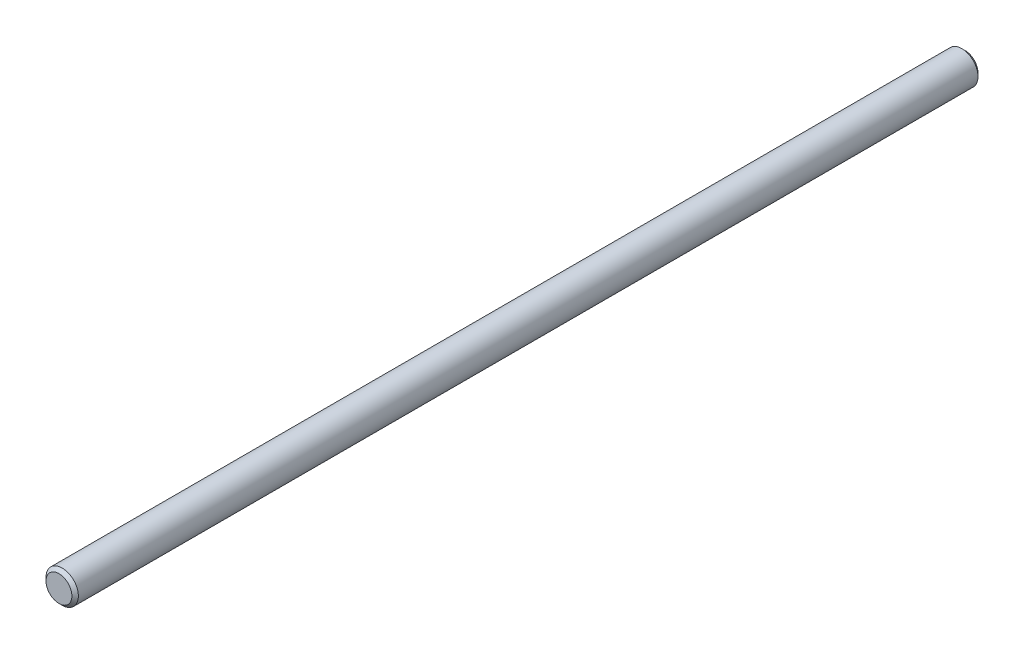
ISO-10303-21;
HEADER;
FILE_DESCRIPTION(('STEP AP214'),'2;1');
FILE_NAME('part.step','',(''),(''),'','','');
FILE_SCHEMA(('AUTOMOTIVE_DESIGN { 1 0 10303 214 1 1 1 1 }'));
ENDSEC;
DATA;
#1=APPLICATION_CONTEXT('core data for automotive mechanical design processes');
#2=APPLICATION_PROTOCOL_DEFINITION('international standard','automotive_design',2000,#1);
#3=PRODUCT_CONTEXT('',#1,'mechanical');
#4=PRODUCT('Part','Part','',(#3));
#5=PRODUCT_RELATED_PRODUCT_CATEGORY('part','',(#4));
#6=PRODUCT_DEFINITION_FORMATION('','',#4);
#7=PRODUCT_DEFINITION_CONTEXT('part definition',#1,'design');
#8=PRODUCT_DEFINITION('design','',#6,#7);
#9=PRODUCT_DEFINITION_SHAPE('','',#8);
#10=(LENGTH_UNIT() NAMED_UNIT(*) SI_UNIT(.MILLI.,.METRE.));
#11=(NAMED_UNIT(*) PLANE_ANGLE_UNIT() SI_UNIT($,.RADIAN.));
#12=(NAMED_UNIT(*) SI_UNIT($,.STERADIAN.) SOLID_ANGLE_UNIT());
#13=UNCERTAINTY_MEASURE_WITH_UNIT(LENGTH_MEASURE(1.E-05),#10,'distance_accuracy_value','');
#14=(GEOMETRIC_REPRESENTATION_CONTEXT(3) GLOBAL_UNCERTAINTY_ASSIGNED_CONTEXT((#13)) GLOBAL_UNIT_ASSIGNED_CONTEXT((#10,
#11,#12)) REPRESENTATION_CONTEXT('',''));
#15=CARTESIAN_POINT('',(0.,0.,0.));
#16=DIRECTION('',(0.,0.,1.));
#17=DIRECTION('',(1.,0.,0.));
#18=AXIS2_PLACEMENT_3D('',#15,#16,#17);
#19=CARTESIAN_POINT('',(0.,0.,56.));
#20=DIRECTION('',(0.,0.,-1.));
#21=DIRECTION('',(-1.,0.,0.));
#22=AXIS2_PLACEMENT_3D('',#19,#20,#21);
#23=CYLINDRICAL_SURFACE('',#22,1.);
#24=CARTESIAN_POINT('',(0.,0.,55.8));
#25=DIRECTION('',(0.,0.,1.));
#26=DIRECTION('',(1.,0.,0.));
#27=AXIS2_PLACEMENT_3D('',#24,#25,#26);
#28=CIRCLE('',#27,1.);
#29=CARTESIAN_POINT('',(1.,0.,55.8));
#30=VERTEX_POINT('',#29);
#31=EDGE_CURVE('E39',#30,#30,#28,.F.);
#32=ORIENTED_EDGE('',*,*,#31,.T.);
#33=EDGE_LOOP('',(#32));
#34=FACE_BOUND('',#33,.T.);
#35=CARTESIAN_POINT('',(0.,0.,0.199999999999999));
#36=DIRECTION('',(0.,0.,1.));
#37=DIRECTION('',(1.,0.,0.));
#38=AXIS2_PLACEMENT_3D('',#35,#36,#37);
#39=CIRCLE('',#38,1.);
#40=CARTESIAN_POINT('',(1.,0.,0.199999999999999));
#41=VERTEX_POINT('',#40);
#42=EDGE_CURVE('E43',#41,#41,#39,.T.);
#43=ORIENTED_EDGE('',*,*,#42,.T.);
#44=EDGE_LOOP('',(#43));
#45=FACE_BOUND('',#44,.T.);
#46=ADVANCED_FACE('F33',(#34,#45),#23,.T.);
#47=CARTESIAN_POINT('',(0.,0.,56.));
#48=DIRECTION('',(0.,0.,1.));
#49=DIRECTION('',(1.,0.,0.));
#50=AXIS2_PLACEMENT_3D('',#47,#48,#49);
#51=PLANE('',#50);
#52=CARTESIAN_POINT('',(0.,0.,56.));
#53=DIRECTION('',(0.,0.,1.));
#54=DIRECTION('',(1.,0.,0.));
#55=AXIS2_PLACEMENT_3D('',#52,#53,#54);
#56=CIRCLE('',#55,0.800000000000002);
#57=CARTESIAN_POINT('',(0.800000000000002,0.,56.));
#58=VERTEX_POINT('',#57);
#59=EDGE_CURVE('E47',#58,#58,#56,.T.);
#60=ORIENTED_EDGE('',*,*,#59,.T.);
#61=EDGE_LOOP('',(#60));
#62=FACE_BOUND('',#61,.T.);
#63=ADVANCED_FACE('F53',(#62),#51,.T.);
#64=CARTESIAN_POINT('',(0.,0.,0.));
#65=DIRECTION('',(0.,0.,1.));
#66=DIRECTION('',(1.,0.,0.));
#67=AXIS2_PLACEMENT_3D('',#64,#65,#66);
#68=PLANE('',#67);
#69=CARTESIAN_POINT('',(0.,0.,0.));
#70=DIRECTION('',(0.,0.,1.));
#71=DIRECTION('',(1.,0.,0.));
#72=AXIS2_PLACEMENT_3D('',#69,#70,#71);
#73=CIRCLE('',#72,0.800000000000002);
#74=CARTESIAN_POINT('',(0.800000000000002,0.,0.));
#75=VERTEX_POINT('',#74);
#76=EDGE_CURVE('E10',#75,#75,#73,.F.);
#77=ORIENTED_EDGE('',*,*,#76,.T.);
#78=EDGE_LOOP('',(#77));
#79=FACE_BOUND('',#78,.T.);
#80=ADVANCED_FACE('F58',(#79),#68,.F.);
#81=CARTESIAN_POINT('',(0.,0.,56.));
#82=DIRECTION('',(0.,0.,-1.));
#83=DIRECTION('',(-1.,0.,0.));
#84=AXIS2_PLACEMENT_3D('',#81,#82,#83);
#85=CONICAL_SURFACE('',#84,0.800000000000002,0.785398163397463);
#86=ORIENTED_EDGE('',*,*,#31,.F.);
#87=EDGE_LOOP('',(#86));
#88=FACE_BOUND('',#87,.T.);
#89=ORIENTED_EDGE('',*,*,#59,.F.);
#90=EDGE_LOOP('',(#89));
#91=FACE_BOUND('',#90,.T.);
#92=ADVANCED_FACE('F55',(#88,#91),#85,.T.);
#93=CARTESIAN_POINT('',(0.,0.,0.199999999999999));
#94=DIRECTION('',(0.,0.,1.));
#95=DIRECTION('',(1.,0.,0.));
#96=AXIS2_PLACEMENT_3D('',#93,#94,#95);
#97=CONICAL_SURFACE('',#96,1.,0.785398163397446);
#98=ORIENTED_EDGE('',*,*,#76,.F.);
#99=EDGE_LOOP('',(#98));
#100=FACE_BOUND('',#99,.T.);
#101=ORIENTED_EDGE('',*,*,#42,.F.);
#102=EDGE_LOOP('',(#101));
#103=FACE_BOUND('',#102,.T.);
#104=ADVANCED_FACE('F57',(#100,#103),#97,.T.);
#105=CLOSED_SHELL('',(#46,#63,#80,#92,#104));
#106=MANIFOLD_SOLID_BREP('B2',#105);
#107=ADVANCED_BREP_SHAPE_REPRESENTATION('',(#18,#106),#14);
#108=SHAPE_DEFINITION_REPRESENTATION(#9,#107);
ENDSEC;
END-ISO-10303-21;
